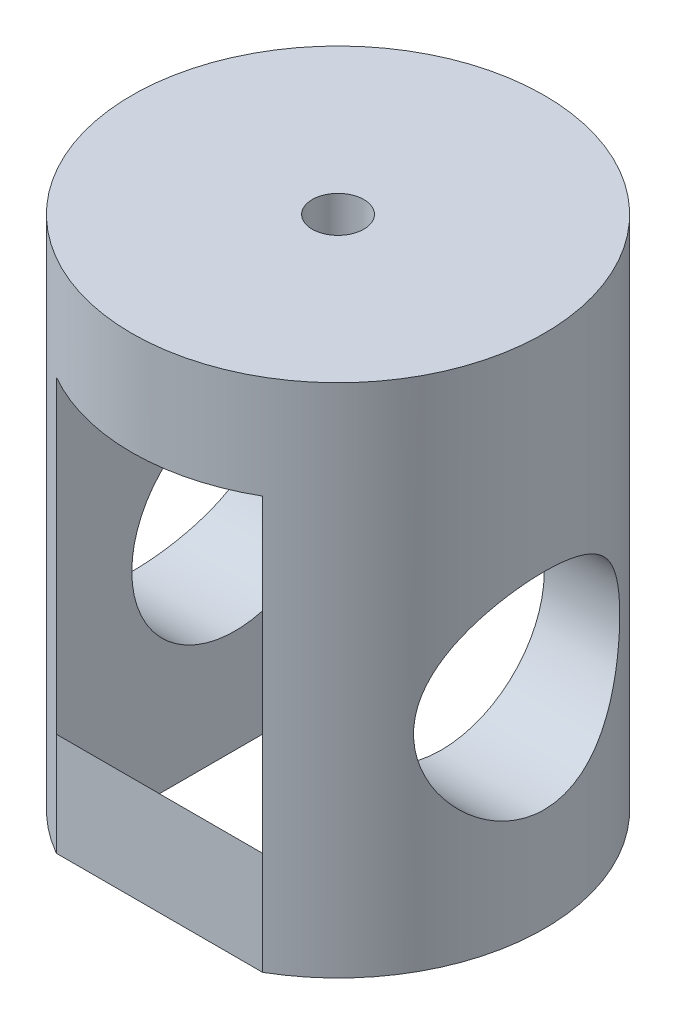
from build123d import *
from build123d.topology import SkipClean

# Parameters (mm, degrees)
BOSS_EXTRUDE1_DEPTH     = 40
BOSS_EXTRUDE1_2_DEPTH   = 40
SKETCH2_R               = 20
SKETCH2_R_2             = 2.5
BOSS_EXTRUDE2_DEPTH     = 10
CUT_EXTRUDE1_DEPTH      = 20
CUT_EXTRUDE1_DEPTH_BACK = 20
SKETCH3_R               = 10
BOSS_EXTRUDE3_DEPTH     = 20


with BuildPart() as part:
    # Sketch1 → Boss-Extrude1 (new body)
    with BuildSketch(Plane(origin=(0, 0, 0), x_dir=(1, 0, 0), z_dir=(0, 1, 0))):
        with BuildLine():
            Line((-10, 17.320508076), (-10, -17.320508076))
            ThreePointArc((-10, -17.320508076), (-20, 0), (-10, 17.320508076))
        make_face()
    extrude(amount=BOSS_EXTRUDE1_DEPTH)



with BuildPart() as body_2:
    # Sketch1 → Boss-Extrude1 2 (new body)
    with BuildSketch(Plane(origin=(0, 0, 0), x_dir=(1, 0, 0), z_dir=(0, 1, 0))):
        with BuildLine():
            Line((10, 17.320508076), (10, -17.320508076))
            ThreePointArc((10, -17.320508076), (20, 0), (10, 17.320508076))
        make_face()
    extrude(amount=BOSS_EXTRUDE1_2_DEPTH)


with BuildPart() as part_1:
    with SkipClean():  # the faces are left unmerged after this step: merging them gives an invalid solid
        add(part.part)

        add(body_2.part)  # Boss-Extrude2 merges body 2
        # Sketch2 → Boss-Extrude2 (add)
        with BuildSketch(Plane(origin=(0, 40, 0), x_dir=(1, 0, 0), z_dir=(0, 1, 0))):
            with Locations(Location((0, 0, 0), (0, 0, 60))):
                Circle(SKETCH2_R)
            with Locations(Location((0, 0, 0), (0, 0, 270))):
                Circle(SKETCH2_R_2, mode=Mode.SUBTRACT)
        extrude(amount=BOSS_EXTRUDE2_DEPTH)

    # Sketch3 → Cut-Extrude1 (cut, two sides: drawn at the far end of the back side and taken through both)
    with SkipClean():  # the faces are left unmerged after this step: merging them gives an invalid solid
        with BuildSketch(Plane(origin=(0, 0, 0), x_dir=(0, 0, -1), z_dir=(1, 0, 0)).offset(-CUT_EXTRUDE1_DEPTH_BACK)):
            with Locations(Location((0, 20, 0), (0, 0, 270))):
                Circle(SKETCH3_R)
        extrude(amount=CUT_EXTRUDE1_DEPTH + CUT_EXTRUDE1_DEPTH_BACK, mode=Mode.SUBTRACT)

    # Sketch4 → Boss-Extrude3 (add)
    with SkipClean():  # the faces are left unmerged after this step: merging them gives an invalid solid
        with BuildSketch(Plane.ZY.offset(-10)):
            with BuildLine():
                Line((17.320508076, 0), (17.320508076, 10))
                ThreePointArc((17.320508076, 10), (14.273082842, 5.990035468), (10.320508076, 2.868534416))
                Line((10.320508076, 2.868534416), (10.320508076, 0))
                Line((10.320508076, 0), (17.320508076, 0))
            make_face()
        extrude(amount=BOSS_EXTRUDE3_DEPTH)


solid = part_1.part
